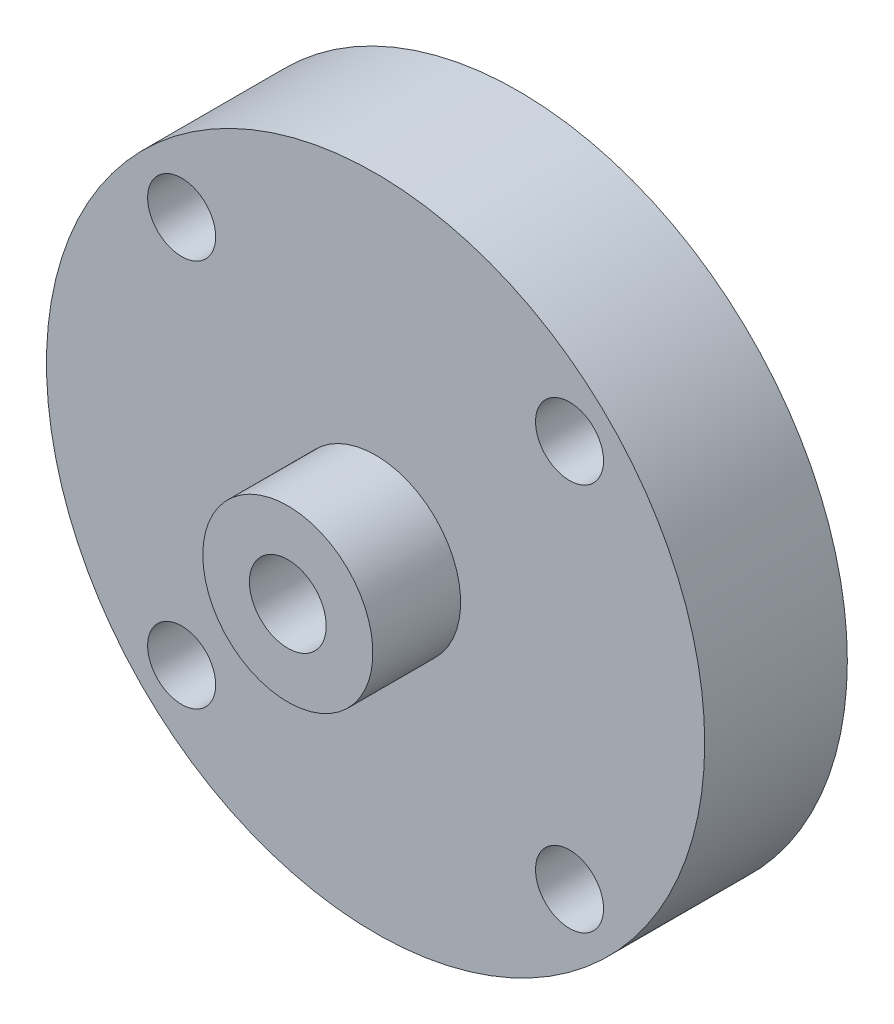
ISO-10303-21;
HEADER;
FILE_DESCRIPTION(('STEP AP214'),'2;1');
FILE_NAME('part.step','',(''),(''),'','','');
FILE_SCHEMA(('AUTOMOTIVE_DESIGN { 1 0 10303 214 1 1 1 1 }'));
ENDSEC;
DATA;
#1=APPLICATION_CONTEXT('core data for automotive mechanical design processes');
#2=APPLICATION_PROTOCOL_DEFINITION('international standard','automotive_design',2000,#1);
#3=PRODUCT_CONTEXT('',#1,'mechanical');
#4=PRODUCT('Part','Part','',(#3));
#5=PRODUCT_RELATED_PRODUCT_CATEGORY('part','',(#4));
#6=PRODUCT_DEFINITION_FORMATION('','',#4);
#7=PRODUCT_DEFINITION_CONTEXT('part definition',#1,'design');
#8=PRODUCT_DEFINITION('design','',#6,#7);
#9=PRODUCT_DEFINITION_SHAPE('','',#8);
#10=(LENGTH_UNIT() NAMED_UNIT(*) SI_UNIT(.MILLI.,.METRE.));
#11=(NAMED_UNIT(*) PLANE_ANGLE_UNIT() SI_UNIT($,.RADIAN.));
#12=(NAMED_UNIT(*) SI_UNIT($,.STERADIAN.) SOLID_ANGLE_UNIT());
#13=UNCERTAINTY_MEASURE_WITH_UNIT(LENGTH_MEASURE(1.E-05),#10,'distance_accuracy_value','');
#14=(GEOMETRIC_REPRESENTATION_CONTEXT(3) GLOBAL_UNCERTAINTY_ASSIGNED_CONTEXT((#13)) GLOBAL_UNIT_ASSIGNED_CONTEXT((#10,
#11,#12)) REPRESENTATION_CONTEXT('',''));
#15=CARTESIAN_POINT('',(0.,0.,0.));
#16=DIRECTION('',(0.,0.,1.));
#17=DIRECTION('',(1.,0.,0.));
#18=AXIS2_PLACEMENT_3D('',#15,#16,#17);
#19=CARTESIAN_POINT('',(1.67957442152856E-12,158.044580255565,-2.));
#20=DIRECTION('',(0.,0.,1.));
#21=DIRECTION('',(1.,0.,0.));
#22=AXIS2_PLACEMENT_3D('',#19,#20,#21);
#23=CYLINDRICAL_SURFACE('',#22,15.);
#24=CARTESIAN_POINT('',(1.67957442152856E-12,158.044580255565,-2.));
#25=DIRECTION('',(0.,0.,1.));
#26=DIRECTION('',(1.,0.,0.));
#27=AXIS2_PLACEMENT_3D('',#24,#25,#26);
#28=CIRCLE('',#27,15.);
#29=CARTESIAN_POINT('',(15.0000000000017,158.044580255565,-2.));
#30=VERTEX_POINT('',#29);
#31=EDGE_CURVE('E11',#30,#30,#28,.T.);
#32=ORIENTED_EDGE('',*,*,#31,.T.);
#33=EDGE_LOOP('',(#32));
#34=FACE_BOUND('',#33,.T.);
#35=CARTESIAN_POINT('',(1.67957442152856E-12,158.044580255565,4.5));
#36=DIRECTION('',(0.,0.,1.));
#37=DIRECTION('',(1.,0.,0.));
#38=AXIS2_PLACEMENT_3D('',#35,#36,#37);
#39=CIRCLE('',#38,15.);
#40=CARTESIAN_POINT('',(15.0000000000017,158.044580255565,4.5));
#41=VERTEX_POINT('',#40);
#42=EDGE_CURVE('E67',#41,#41,#39,.T.);
#43=ORIENTED_EDGE('',*,*,#42,.F.);
#44=EDGE_LOOP('',(#43));
#45=FACE_BOUND('',#44,.T.);
#46=ADVANCED_FACE('F39',(#34,#45),#23,.T.);
#47=CARTESIAN_POINT('',(1.67957442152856E-12,158.044580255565,-2.));
#48=DIRECTION('',(0.,0.,1.));
#49=DIRECTION('',(1.,0.,0.));
#50=AXIS2_PLACEMENT_3D('',#47,#48,#49);
#51=PLANE('',#50);
#52=CARTESIAN_POINT('',(3.82246317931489E-12,158.044580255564,-2.));
#53=DIRECTION('',(0.,0.,-1.));
#54=DIRECTION('',(-1.,0.,0.));
#55=AXIS2_PLACEMENT_3D('',#52,#53,#54);
#56=CIRCLE('',#55,2.87500000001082);
#57=CARTESIAN_POINT('',(-2.87500000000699,158.044580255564,-2.));
#58=VERTEX_POINT('',#57);
#59=EDGE_CURVE('E83',#58,#58,#56,.T.);
#60=ORIENTED_EDGE('',*,*,#59,.F.);
#61=EDGE_LOOP('',(#60));
#62=FACE_BOUND('',#61,.T.);
#63=CARTESIAN_POINT('',(8.83883476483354,166.883415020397,-2.));
#64=DIRECTION('',(0.,0.,1.));
#65=DIRECTION('',(1.,0.,0.));
#66=AXIS2_PLACEMENT_3D('',#63,#64,#65);
#67=CIRCLE('',#66,1.55);
#68=CARTESIAN_POINT('',(10.3888347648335,166.883415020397,-2.));
#69=VERTEX_POINT('',#68);
#70=EDGE_CURVE('E58',#69,#69,#67,.T.);
#71=ORIENTED_EDGE('',*,*,#70,.T.);
#72=EDGE_LOOP('',(#71));
#73=FACE_BOUND('',#72,.T.);
#74=CARTESIAN_POINT('',(-8.83883476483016,166.883415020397,-2.));
#75=DIRECTION('',(0.,0.,1.));
#76=DIRECTION('',(1.,0.,0.));
#77=AXIS2_PLACEMENT_3D('',#74,#75,#76);
#78=CIRCLE('',#77,1.55);
#79=CARTESIAN_POINT('',(-7.28883476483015,166.883415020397,-2.));
#80=VERTEX_POINT('',#79);
#81=EDGE_CURVE('E55',#80,#80,#78,.T.);
#82=ORIENTED_EDGE('',*,*,#81,.T.);
#83=EDGE_LOOP('',(#82));
#84=FACE_BOUND('',#83,.T.);
#85=CARTESIAN_POINT('',(-8.83883476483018,149.205745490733,-2.));
#86=DIRECTION('',(0.,0.,1.));
#87=DIRECTION('',(1.,0.,0.));
#88=AXIS2_PLACEMENT_3D('',#85,#86,#87);
#89=CIRCLE('',#88,1.55);
#90=CARTESIAN_POINT('',(-7.28883476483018,149.205745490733,-2.));
#91=VERTEX_POINT('',#90);
#92=EDGE_CURVE('E50',#91,#91,#89,.T.);
#93=ORIENTED_EDGE('',*,*,#92,.T.);
#94=EDGE_LOOP('',(#93));
#95=FACE_BOUND('',#94,.T.);
#96=CARTESIAN_POINT('',(8.83883476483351,149.205745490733,-2.));
#97=DIRECTION('',(0.,0.,1.));
#98=DIRECTION('',(1.,0.,0.));
#99=AXIS2_PLACEMENT_3D('',#96,#97,#98);
#100=CIRCLE('',#99,1.55);
#101=CARTESIAN_POINT('',(10.3888347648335,149.205745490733,-2.));
#102=VERTEX_POINT('',#101);
#103=EDGE_CURVE('E46',#102,#102,#100,.T.);
#104=ORIENTED_EDGE('',*,*,#103,.T.);
#105=EDGE_LOOP('',(#104));
#106=FACE_BOUND('',#105,.T.);
#107=ORIENTED_EDGE('',*,*,#31,.F.);
#108=EDGE_LOOP('',(#107));
#109=FACE_BOUND('',#108,.T.);
#110=ADVANCED_FACE('F111',(#62,#73,#84,#95,#106,#109),#51,.F.);
#111=CARTESIAN_POINT('',(8.83883476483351,149.205745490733,-2.));
#112=DIRECTION('',(0.,0.,1.));
#113=DIRECTION('',(1.,0.,0.));
#114=AXIS2_PLACEMENT_3D('',#111,#112,#113);
#115=CYLINDRICAL_SURFACE('',#114,1.55);
#116=ORIENTED_EDGE('',*,*,#103,.F.);
#117=EDGE_LOOP('',(#116));
#118=FACE_BOUND('',#117,.T.);
#119=CARTESIAN_POINT('',(8.83883476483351,149.205745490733,4.5));
#120=DIRECTION('',(0.,0.,1.));
#121=DIRECTION('',(1.,0.,0.));
#122=AXIS2_PLACEMENT_3D('',#119,#120,#121);
#123=CIRCLE('',#122,1.55);
#124=CARTESIAN_POINT('',(10.3888347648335,149.205745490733,4.5));
#125=VERTEX_POINT('',#124);
#126=EDGE_CURVE('E70',#125,#125,#123,.F.);
#127=ORIENTED_EDGE('',*,*,#126,.F.);
#128=EDGE_LOOP('',(#127));
#129=FACE_BOUND('',#128,.T.);
#130=ADVANCED_FACE('F114',(#118,#129),#115,.F.);
#131=CARTESIAN_POINT('',(-8.83883476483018,149.205745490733,-2.));
#132=DIRECTION('',(0.,0.,1.));
#133=DIRECTION('',(1.,0.,0.));
#134=AXIS2_PLACEMENT_3D('',#131,#132,#133);
#135=CYLINDRICAL_SURFACE('',#134,1.55);
#136=ORIENTED_EDGE('',*,*,#92,.F.);
#137=EDGE_LOOP('',(#136));
#138=FACE_BOUND('',#137,.T.);
#139=CARTESIAN_POINT('',(-8.83883476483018,149.205745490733,4.5));
#140=DIRECTION('',(0.,0.,1.));
#141=DIRECTION('',(1.,0.,0.));
#142=AXIS2_PLACEMENT_3D('',#139,#140,#141);
#143=CIRCLE('',#142,1.55);
#144=CARTESIAN_POINT('',(-7.28883476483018,149.205745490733,4.5));
#145=VERTEX_POINT('',#144);
#146=EDGE_CURVE('E64',#145,#145,#143,.F.);
#147=ORIENTED_EDGE('',*,*,#146,.F.);
#148=EDGE_LOOP('',(#147));
#149=FACE_BOUND('',#148,.T.);
#150=ADVANCED_FACE('F126',(#138,#149),#135,.F.);
#151=CARTESIAN_POINT('',(-8.83883476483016,166.883415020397,-2.));
#152=DIRECTION('',(0.,0.,1.));
#153=DIRECTION('',(1.,0.,0.));
#154=AXIS2_PLACEMENT_3D('',#151,#152,#153);
#155=CYLINDRICAL_SURFACE('',#154,1.55);
#156=ORIENTED_EDGE('',*,*,#81,.F.);
#157=EDGE_LOOP('',(#156));
#158=FACE_BOUND('',#157,.T.);
#159=CARTESIAN_POINT('',(-8.83883476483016,166.883415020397,4.5));
#160=DIRECTION('',(0.,0.,1.));
#161=DIRECTION('',(1.,0.,0.));
#162=AXIS2_PLACEMENT_3D('',#159,#160,#161);
#163=CIRCLE('',#162,1.55);
#164=CARTESIAN_POINT('',(-7.28883476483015,166.883415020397,4.5));
#165=VERTEX_POINT('',#164);
#166=EDGE_CURVE('E73',#165,#165,#163,.F.);
#167=ORIENTED_EDGE('',*,*,#166,.F.);
#168=EDGE_LOOP('',(#167));
#169=FACE_BOUND('',#168,.T.);
#170=ADVANCED_FACE('F144',(#158,#169),#155,.F.);
#171=CARTESIAN_POINT('',(8.83883476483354,166.883415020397,-2.));
#172=DIRECTION('',(0.,0.,1.));
#173=DIRECTION('',(1.,0.,0.));
#174=AXIS2_PLACEMENT_3D('',#171,#172,#173);
#175=CYLINDRICAL_SURFACE('',#174,1.55);
#176=ORIENTED_EDGE('',*,*,#70,.F.);
#177=EDGE_LOOP('',(#176));
#178=FACE_BOUND('',#177,.T.);
#179=CARTESIAN_POINT('',(8.83883476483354,166.883415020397,4.5));
#180=DIRECTION('',(0.,0.,1.));
#181=DIRECTION('',(1.,0.,0.));
#182=AXIS2_PLACEMENT_3D('',#179,#180,#181);
#183=CIRCLE('',#182,1.55);
#184=CARTESIAN_POINT('',(10.3888347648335,166.883415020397,4.5));
#185=VERTEX_POINT('',#184);
#186=EDGE_CURVE('E61',#185,#185,#183,.F.);
#187=ORIENTED_EDGE('',*,*,#186,.F.);
#188=EDGE_LOOP('',(#187));
#189=FACE_BOUND('',#188,.T.);
#190=ADVANCED_FACE('F134',(#178,#189),#175,.F.);
#191=CARTESIAN_POINT('',(0.,0.,4.5));
#192=DIRECTION('',(0.,0.,1.));
#193=DIRECTION('',(1.,0.,0.));
#194=AXIS2_PLACEMENT_3D('',#191,#192,#193);
#195=PLANE('',#194);
#196=CARTESIAN_POINT('',(1.67957442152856E-12,158.044580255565,4.5));
#197=DIRECTION('',(0.,0.,1.));
#198=DIRECTION('',(1.,0.,0.));
#199=AXIS2_PLACEMENT_3D('',#196,#197,#198);
#200=CIRCLE('',#199,3.875);
#201=CARTESIAN_POINT('',(-3.87499999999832,158.044580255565,4.5));
#202=VERTEX_POINT('',#201);
#203=EDGE_CURVE('E76',#202,#202,#200,.T.);
#204=ORIENTED_EDGE('',*,*,#203,.F.);
#205=EDGE_LOOP('',(#204));
#206=FACE_BOUND('',#205,.T.);
#207=ORIENTED_EDGE('',*,*,#166,.T.);
#208=EDGE_LOOP('',(#207));
#209=FACE_BOUND('',#208,.T.);
#210=ORIENTED_EDGE('',*,*,#126,.T.);
#211=EDGE_LOOP('',(#210));
#212=FACE_BOUND('',#211,.T.);
#213=ORIENTED_EDGE('',*,*,#42,.T.);
#214=EDGE_LOOP('',(#213));
#215=FACE_BOUND('',#214,.T.);
#216=ORIENTED_EDGE('',*,*,#146,.T.);
#217=EDGE_LOOP('',(#216));
#218=FACE_BOUND('',#217,.T.);
#219=ORIENTED_EDGE('',*,*,#186,.T.);
#220=EDGE_LOOP('',(#219));
#221=FACE_BOUND('',#220,.T.);
#222=ADVANCED_FACE('F130',(#206,#209,#212,#215,#218,#221),#195,.T.);
#223=CARTESIAN_POINT('',(1.67957442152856E-12,158.044580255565,23.4601551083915));
#224=DIRECTION('',(0.,0.,-1.));
#225=DIRECTION('',(-1.,0.,0.));
#226=AXIS2_PLACEMENT_3D('',#223,#224,#225);
#227=CYLINDRICAL_SURFACE('',#226,3.875);
#228=CARTESIAN_POINT('',(1.67957442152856E-12,158.044580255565,8.5));
#229=DIRECTION('',(0.,0.,1.));
#230=DIRECTION('',(1.,0.,0.));
#231=AXIS2_PLACEMENT_3D('',#228,#229,#230);
#232=CIRCLE('',#231,3.875);
#233=CARTESIAN_POINT('',(-3.87499999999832,158.044580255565,8.5));
#234=VERTEX_POINT('',#233);
#235=EDGE_CURVE('E79',#234,#234,#232,.T.);
#236=CARTESIAN_POINT('',(-3.87499999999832,158.044580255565,4.5));
#237=CARTESIAN_POINT('',(-3.87499999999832,158.044580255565,4.54166666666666));
#238=CARTESIAN_POINT('',(-3.87499999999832,158.044580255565,4.58333333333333));
#239=CARTESIAN_POINT('',(-3.87499999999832,158.044580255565,4.66666666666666));
#240=CARTESIAN_POINT('',(-3.87499999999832,158.044580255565,4.70833333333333));
#241=CARTESIAN_POINT('',(-3.87499999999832,158.044580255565,4.79166666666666));
#242=CARTESIAN_POINT('',(-3.87499999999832,158.044580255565,4.83333333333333));
#243=CARTESIAN_POINT('',(-3.87499999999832,158.044580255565,4.91666666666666));
#244=CARTESIAN_POINT('',(-3.87499999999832,158.044580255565,4.95833333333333));
#245=CARTESIAN_POINT('',(-3.87499999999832,158.044580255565,5.04166666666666));
#246=CARTESIAN_POINT('',(-3.87499999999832,158.044580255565,5.08333333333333));
#247=CARTESIAN_POINT('',(-3.87499999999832,158.044580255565,5.16666666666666));
#248=CARTESIAN_POINT('',(-3.87499999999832,158.044580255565,5.20833333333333));
#249=CARTESIAN_POINT('',(-3.87499999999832,158.044580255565,5.29166666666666));
#250=CARTESIAN_POINT('',(-3.87499999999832,158.044580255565,5.33333333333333));
#251=CARTESIAN_POINT('',(-3.87499999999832,158.044580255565,5.41666666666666));
#252=CARTESIAN_POINT('',(-3.87499999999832,158.044580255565,5.45833333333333));
#253=CARTESIAN_POINT('',(-3.87499999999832,158.044580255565,5.54166666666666));
#254=CARTESIAN_POINT('',(-3.87499999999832,158.044580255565,5.58333333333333));
#255=CARTESIAN_POINT('',(-3.87499999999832,158.044580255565,5.66666666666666));
#256=CARTESIAN_POINT('',(-3.87499999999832,158.044580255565,5.70833333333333));
#257=CARTESIAN_POINT('',(-3.87499999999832,158.044580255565,5.79166666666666));
#258=CARTESIAN_POINT('',(-3.87499999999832,158.044580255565,5.83333333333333));
#259=CARTESIAN_POINT('',(-3.87499999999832,158.044580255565,5.91666666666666));
#260=CARTESIAN_POINT('',(-3.87499999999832,158.044580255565,5.95833333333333));
#261=CARTESIAN_POINT('',(-3.87499999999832,158.044580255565,6.04166666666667));
#262=CARTESIAN_POINT('',(-3.87499999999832,158.044580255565,6.08333333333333));
#263=CARTESIAN_POINT('',(-3.87499999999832,158.044580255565,6.16666666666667));
#264=CARTESIAN_POINT('',(-3.87499999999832,158.044580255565,6.20833333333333));
#265=CARTESIAN_POINT('',(-3.87499999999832,158.044580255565,6.29166666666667));
#266=CARTESIAN_POINT('',(-3.87499999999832,158.044580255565,6.33333333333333));
#267=CARTESIAN_POINT('',(-3.87499999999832,158.044580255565,6.41666666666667));
#268=CARTESIAN_POINT('',(-3.87499999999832,158.044580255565,6.45833333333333));
#269=CARTESIAN_POINT('',(-3.87499999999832,158.044580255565,6.54166666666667));
#270=CARTESIAN_POINT('',(-3.87499999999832,158.044580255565,6.58333333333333));
#271=CARTESIAN_POINT('',(-3.87499999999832,158.044580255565,6.66666666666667));
#272=CARTESIAN_POINT('',(-3.87499999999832,158.044580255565,6.70833333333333));
#273=CARTESIAN_POINT('',(-3.87499999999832,158.044580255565,6.79166666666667));
#274=CARTESIAN_POINT('',(-3.87499999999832,158.044580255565,6.83333333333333));
#275=CARTESIAN_POINT('',(-3.87499999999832,158.044580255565,6.91666666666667));
#276=CARTESIAN_POINT('',(-3.87499999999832,158.044580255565,6.95833333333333));
#277=CARTESIAN_POINT('',(-3.87499999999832,158.044580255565,7.04166666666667));
#278=CARTESIAN_POINT('',(-3.87499999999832,158.044580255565,7.08333333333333));
#279=CARTESIAN_POINT('',(-3.87499999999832,158.044580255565,7.16666666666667));
#280=CARTESIAN_POINT('',(-3.87499999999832,158.044580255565,7.20833333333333));
#281=CARTESIAN_POINT('',(-3.87499999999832,158.044580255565,7.29166666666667));
#282=CARTESIAN_POINT('',(-3.87499999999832,158.044580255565,7.33333333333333));
#283=CARTESIAN_POINT('',(-3.87499999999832,158.044580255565,7.41666666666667));
#284=CARTESIAN_POINT('',(-3.87499999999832,158.044580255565,7.45833333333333));
#285=CARTESIAN_POINT('',(-3.87499999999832,158.044580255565,7.54166666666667));
#286=CARTESIAN_POINT('',(-3.87499999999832,158.044580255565,7.58333333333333));
#287=CARTESIAN_POINT('',(-3.87499999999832,158.044580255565,7.66666666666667));
#288=CARTESIAN_POINT('',(-3.87499999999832,158.044580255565,7.70833333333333));
#289=CARTESIAN_POINT('',(-3.87499999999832,158.044580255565,7.79166666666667));
#290=CARTESIAN_POINT('',(-3.87499999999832,158.044580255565,7.83333333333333));
#291=CARTESIAN_POINT('',(-3.87499999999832,158.044580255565,7.91666666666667));
#292=CARTESIAN_POINT('',(-3.87499999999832,158.044580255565,7.95833333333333));
#293=CARTESIAN_POINT('',(-3.87499999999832,158.044580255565,8.04166666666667));
#294=CARTESIAN_POINT('',(-3.87499999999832,158.044580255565,8.08333333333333));
#295=CARTESIAN_POINT('',(-3.87499999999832,158.044580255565,8.16666666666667));
#296=CARTESIAN_POINT('',(-3.87499999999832,158.044580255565,8.20833333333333));
#297=CARTESIAN_POINT('',(-3.87499999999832,158.044580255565,8.29166666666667));
#298=CARTESIAN_POINT('',(-3.87499999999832,158.044580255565,8.33333333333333));
#299=CARTESIAN_POINT('',(-3.87499999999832,158.044580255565,8.41666666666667));
#300=CARTESIAN_POINT('',(-3.87499999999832,158.044580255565,8.45833333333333));
#301=CARTESIAN_POINT('',(-3.87499999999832,158.044580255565,8.5));
#302=B_SPLINE_CURVE_WITH_KNOTS('',3,(#236,#237,#238,#239,#240,#241,#242,#243,#244,#245,#246,
#247,#248,#249,#250,#251,#252,#253,#254,#255,#256,#257,#258,#259,#260,#261,#262,#263,#264,#265,
#266,#267,#268,#269,#270,#271,#272,#273,#274,#275,#276,#277,#278,#279,#280,#281,#282,#283,#284,
#285,#286,#287,#288,#289,#290,#291,#292,#293,#294,#295,#296,#297,#298,#299,#300,#301),
.UNSPECIFIED.,.F.,.F.,(4,2,2,2,2,2,2,2,2,2,2,2,2,2,2,2,2,2,2,2,2,2,2,2,2,2,2,2,2,2,2,2,4),(0.,
0.125,0.25,0.375,0.5,0.625000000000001,0.750000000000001,0.875000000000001,1.,1.125,1.25,1.375,
1.5,1.625,1.75,1.875,2.,2.125,2.25,2.375,2.5,2.625,2.75,2.875,3.,3.125,3.25,3.375,3.5,3.625,
3.75,3.875,4.),.UNSPECIFIED.);
#303=EDGE_CURVE('BSEAM133',#202,#234,#302,.T.);
#304=ORIENTED_EDGE('',*,*,#203,.T.);
#305=ORIENTED_EDGE('',*,*,#235,.F.);
#306=ORIENTED_EDGE('',*,*,#303,.T.);
#307=ORIENTED_EDGE('',*,*,#303,.F.);
#308=EDGE_LOOP('',(#304,#306,#305,#307));
#309=FACE_BOUND('',#308,.T.);
#310=ADVANCED_FACE('F133',(#309),#227,.T.);
#311=CARTESIAN_POINT('',(0.,0.,8.5));
#312=DIRECTION('',(0.,0.,1.));
#313=DIRECTION('',(1.,0.,0.));
#314=AXIS2_PLACEMENT_3D('',#311,#312,#313);
#315=PLANE('',#314);
#316=CARTESIAN_POINT('',(3.41393580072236E-12,158.044580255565,8.5));
#317=DIRECTION('',(0.,0.,-1.));
#318=DIRECTION('',(-1.,0.,0.));
#319=AXIS2_PLACEMENT_3D('',#316,#317,#318);
#320=CIRCLE('',#319,1.74999999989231);
#321=CARTESIAN_POINT('',(-1.74999999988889,158.044580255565,8.5));
#322=VERTEX_POINT('',#321);
#323=EDGE_CURVE('E88',#322,#322,#320,.T.);
#324=ORIENTED_EDGE('',*,*,#323,.T.);
#325=EDGE_LOOP('',(#324));
#326=FACE_BOUND('',#325,.T.);
#327=ORIENTED_EDGE('',*,*,#235,.T.);
#328=EDGE_LOOP('',(#327));
#329=FACE_BOUND('',#328,.T.);
#330=ADVANCED_FACE('F102',(#326,#329),#315,.T.);
#331=CARTESIAN_POINT('',(3.82246317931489E-12,158.044580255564,1.3));
#332=DIRECTION('',(0.,0.,-1.));
#333=DIRECTION('',(-1.,0.,0.));
#334=AXIS2_PLACEMENT_3D('',#331,#332,#333);
#335=PLANE('',#334);
#336=CARTESIAN_POINT('',(3.41393580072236E-12,158.044580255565,1.3));
#337=DIRECTION('',(0.,0.,-1.));
#338=DIRECTION('',(-1.,0.,0.));
#339=AXIS2_PLACEMENT_3D('',#336,#337,#338);
#340=CIRCLE('',#339,1.74999999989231);
#341=CARTESIAN_POINT('',(-1.74999999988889,158.044580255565,1.3));
#342=VERTEX_POINT('',#341);
#343=EDGE_CURVE('E42',#342,#342,#340,.T.);
#344=ORIENTED_EDGE('',*,*,#343,.F.);
#345=EDGE_LOOP('',(#344));
#346=FACE_BOUND('',#345,.T.);
#347=CARTESIAN_POINT('',(3.82246317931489E-12,158.044580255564,1.3));
#348=DIRECTION('',(0.,0.,-1.));
#349=DIRECTION('',(-1.,0.,0.));
#350=AXIS2_PLACEMENT_3D('',#347,#348,#349);
#351=CIRCLE('',#350,2.87500000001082);
#352=CARTESIAN_POINT('',(-2.87500000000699,158.044580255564,1.3));
#353=VERTEX_POINT('',#352);
#354=EDGE_CURVE('E82',#353,#353,#351,.T.);
#355=ORIENTED_EDGE('',*,*,#354,.T.);
#356=EDGE_LOOP('',(#355));
#357=FACE_BOUND('',#356,.T.);
#358=ADVANCED_FACE('F98',(#346,#357),#335,.T.);
#359=CARTESIAN_POINT('',(3.82246317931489E-12,158.044580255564,1.3));
#360=DIRECTION('',(0.,0.,-1.));
#361=DIRECTION('',(-1.,0.,0.));
#362=AXIS2_PLACEMENT_3D('',#359,#360,#361);
#363=CYLINDRICAL_SURFACE('',#362,2.87500000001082);
#364=ORIENTED_EDGE('',*,*,#354,.F.);
#365=EDGE_LOOP('',(#364));
#366=FACE_BOUND('',#365,.T.);
#367=ORIENTED_EDGE('',*,*,#59,.T.);
#368=EDGE_LOOP('',(#367));
#369=FACE_BOUND('',#368,.T.);
#370=ADVANCED_FACE('F101',(#366,#369),#363,.F.);
#371=CARTESIAN_POINT('',(3.41393580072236E-12,158.044580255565,8.5));
#372=DIRECTION('',(0.,0.,-1.));
#373=DIRECTION('',(-1.,0.,0.));
#374=AXIS2_PLACEMENT_3D('',#371,#372,#373);
#375=CYLINDRICAL_SURFACE('',#374,1.74999999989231);
#376=ORIENTED_EDGE('',*,*,#343,.T.);
#377=EDGE_LOOP('',(#376));
#378=FACE_BOUND('',#377,.T.);
#379=ORIENTED_EDGE('',*,*,#323,.F.);
#380=EDGE_LOOP('',(#379));
#381=FACE_BOUND('',#380,.T.);
#382=ADVANCED_FACE('F95',(#378,#381),#375,.F.);
#383=CLOSED_SHELL('',(#46,#110,#130,#150,#170,#190,#222,#310,#330,#358,#370,#382));
#384=MANIFOLD_SOLID_BREP('B2',#383);
#385=ADVANCED_BREP_SHAPE_REPRESENTATION('',(#18,#384),#14);
#386=SHAPE_DEFINITION_REPRESENTATION(#9,#385);
ENDSEC;
END-ISO-10303-21;
